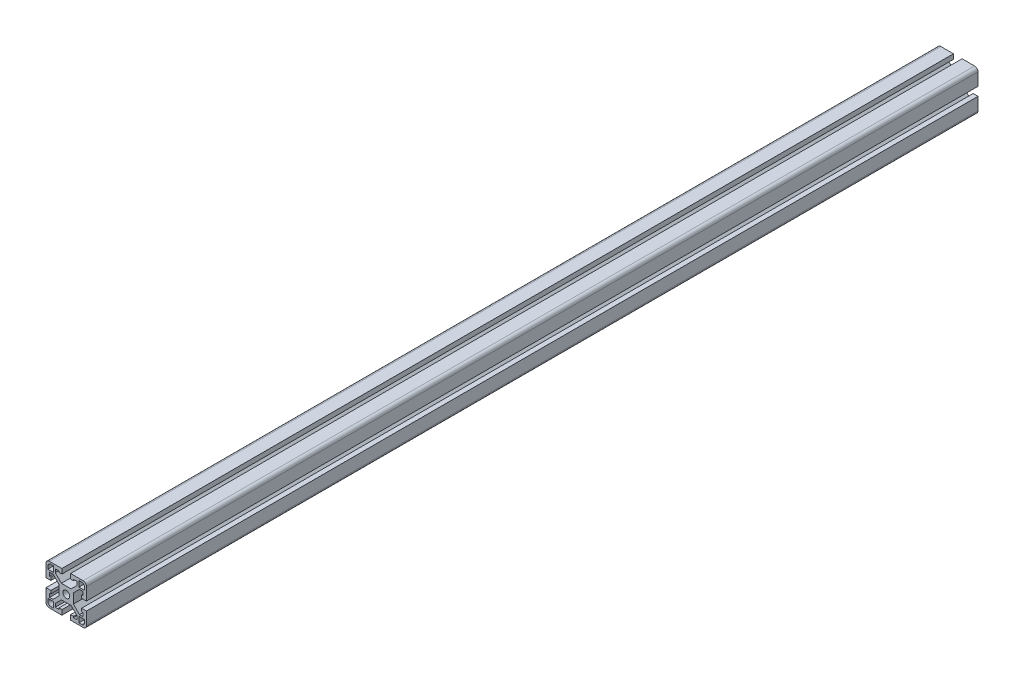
from build123d import *

# Parameters (mm, degrees)
SKETCH1_R           = 3.2639
BOSS_EXTRUDE1_DEPTH = 839.089


with BuildPart() as part:
    # Sketch1 → Boss-Extrude1 (new body)
    with BuildSketch(Plane.XY):
        with BuildLine():
            Line((-6.731, 4.575738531), (-6.731, -4.575738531))
            Line((-6.731, -4.575738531), (-12.442261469, -10.287))
            Line((-12.442261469, -10.287), (-15.6718, -10.287))
            Line((-15.6718, -10.287), (-15.6718, -6.858))
            Line((-15.6718, -6.858), (-14.478, -6.858))
            Line((-14.478, -6.858), (-14.478, -4.064))
            Line((-14.478, -4.064), (-19.05, -4.064))
            Line((-19.05, -4.064), (-19.05, -15.875))
            ThreePointArc((-19.05, -15.875), (-18.12006403, -18.12006403), (-15.875, -19.05))
            Line((-15.875, -19.05), (-4.064, -19.05))
            Line((-4.064, -19.05), (-4.064, -14.478))
            Line((-4.064, -14.478), (-6.858, -14.478))
            Line((-6.858, -14.478), (-6.858, -15.6718))
            Line((-6.858, -15.6718), (-10.287, -15.6718))
            Line((-10.287, -15.6718), (-10.287, -12.442261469))
            Line((-10.287, -12.442261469), (-4.575738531, -6.731))
            Line((-4.575738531, -6.731), (4.575738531, -6.731))
            Line((4.575738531, -6.731), (10.287, -12.442261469))
            Line((10.287, -12.442261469), (10.287, -15.6718))
            Line((10.287, -15.6718), (6.858, -15.6718))
            Line((6.858, -15.6718), (6.858, -14.478))
            Line((6.858, -14.478), (4.064, -14.478))
            Line((4.064, -14.478), (4.064, -19.05))
            Line((4.064, -19.05), (15.875, -19.05))
            ThreePointArc((15.875, -19.05), (18.12006403, -18.12006403), (19.05, -15.875))
            Line((19.05, -15.875), (19.05, -4.064))
            Line((19.05, -4.064), (14.478, -4.064))
            Line((14.478, -4.064), (14.478, -6.858))
            Line((14.478, -6.858), (15.6718, -6.858))
            Line((15.6718, -6.858), (15.6718, -10.287))
            Line((15.6718, -10.287), (12.442261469, -10.287))
            Line((12.442261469, -10.287), (6.731, -4.575738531))
            Line((6.731, -4.575738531), (6.731, 4.575738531))
            Line((6.731, 4.575738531), (12.442261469, 10.287))
            Line((12.442261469, 10.287), (15.6718, 10.287))
            Line((15.6718, 10.287), (15.6718, 6.858))
            Line((15.6718, 6.858), (14.478, 6.858))
            Line((14.478, 6.858), (14.478, 4.064))
            Line((14.478, 4.064), (19.05, 4.064))
            Line((19.05, 4.064), (19.05, 15.875))
            ThreePointArc((19.05, 15.875), (18.12006403, 18.12006403), (15.875, 19.05))
            Line((15.875, 19.05), (4.064, 19.05))
            Line((4.064, 19.05), (4.064, 14.478))
            Line((4.064, 14.478), (6.858, 14.478))
            Line((6.858, 14.478), (6.858, 15.6718))
            Line((6.858, 15.6718), (10.287, 15.6718))
            Line((10.287, 15.6718), (10.287, 12.442261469))
            Line((10.287, 12.442261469), (4.575738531, 6.731))
            Line((4.575738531, 6.731), (-4.575738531, 6.731))
            Line((-4.575738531, 6.731), (-10.287, 12.442261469))
            Line((-10.287, 12.442261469), (-10.287, 15.6718))
            Line((-10.287, 15.6718), (-6.858, 15.6718))
            Line((-6.858, 15.6718), (-6.858, 14.478))
            Line((-6.858, 14.478), (-4.064, 14.478))
            Line((-4.064, 14.478), (-4.064, 19.05))
            Line((-4.064, 19.05), (-15.875, 19.05))
            ThreePointArc((-15.875, 19.05), (-18.12006403, 18.12006403), (-19.05, 15.875))
            Line((-19.05, 15.875), (-19.05, 4.064))
            Line((-19.05, 4.064), (-14.478, 4.064))
            Line((-14.478, 4.064), (-14.478, 6.858))
            Line((-14.478, 6.858), (-15.6718, 6.858))
            Line((-15.6718, 6.858), (-15.6718, 10.287))
            Line((-15.6718, 10.287), (-12.442261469, 10.287))
            Line((-12.442261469, 10.287), (-6.731, 4.575738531))
        make_face()
        Circle(SKETCH1_R, mode=Mode.SUBTRACT)
        with BuildLine():
            Line((-11.8872, 17.272), (-14.478, 17.272))
            ThreePointArc((-14.478, 17.272), (-16.453656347, 16.453656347), (-17.272, 14.478))
            Line((-17.272, 14.478), (-17.272, 11.8872))
            Line((-17.272, 11.8872), (-11.8872, 11.8872))
            Line((-11.8872, 11.8872), (-11.8872, 17.272))
        make_face(mode=Mode.SUBTRACT)
        with BuildLine():
            Line((14.478, 17.272), (11.8872, 17.272))
            Line((11.8872, 17.272), (11.8872, 11.8872))
            Line((11.8872, 11.8872), (17.272, 11.8872))
            Line((17.272, 11.8872), (17.272, 14.478))
            ThreePointArc((17.272, 14.478), (16.453656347, 16.453656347), (14.478, 17.272))
        make_face(mode=Mode.SUBTRACT)
        with BuildLine():
            Line((11.8872, -17.272), (14.478, -17.272))
            ThreePointArc((14.478, -17.272), (16.453656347, -16.453656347), (17.272, -14.478))
            Line((17.272, -14.478), (17.272, -11.8872))
            Line((17.272, -11.8872), (11.8872, -11.8872))
            Line((11.8872, -11.8872), (11.8872, -17.272))
        make_face(mode=Mode.SUBTRACT)
        with BuildLine():
            Line((-14.478, -17.272), (-11.8872, -17.272))
            Line((-11.8872, -17.272), (-11.8872, -11.8872))
            Line((-11.8872, -11.8872), (-17.272, -11.8872))
            Line((-17.272, -11.8872), (-17.272, -14.478))
            ThreePointArc((-17.272, -14.478), (-16.453656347, -16.453656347), (-14.478, -17.272))
        make_face(mode=Mode.SUBTRACT)
    extrude(amount=-BOSS_EXTRUDE1_DEPTH)


solid = part.part
